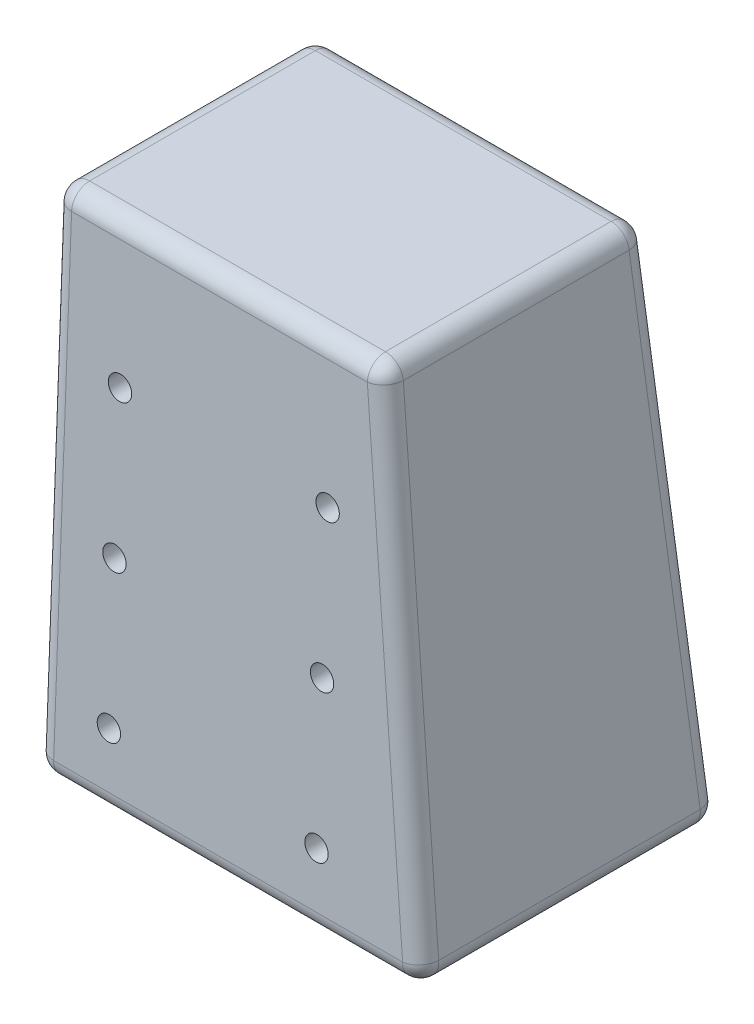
ISO-10303-21;
HEADER;
FILE_DESCRIPTION(('STEP AP214'),'2;1');
FILE_NAME('part.step','',(''),(''),'','','');
FILE_SCHEMA(('AUTOMOTIVE_DESIGN { 1 0 10303 214 1 1 1 1 }'));
ENDSEC;
DATA;
#1=APPLICATION_CONTEXT('core data for automotive mechanical design processes');
#2=APPLICATION_PROTOCOL_DEFINITION('international standard','automotive_design',2000,#1);
#3=PRODUCT_CONTEXT('',#1,'mechanical');
#4=PRODUCT('Part','Part','',(#3));
#5=PRODUCT_RELATED_PRODUCT_CATEGORY('part','',(#4));
#6=PRODUCT_DEFINITION_FORMATION('','',#4);
#7=PRODUCT_DEFINITION_CONTEXT('part definition',#1,'design');
#8=PRODUCT_DEFINITION('design','',#6,#7);
#9=PRODUCT_DEFINITION_SHAPE('','',#8);
#10=(LENGTH_UNIT() NAMED_UNIT(*) SI_UNIT(.MILLI.,.METRE.));
#11=(NAMED_UNIT(*) PLANE_ANGLE_UNIT() SI_UNIT($,.RADIAN.));
#12=(NAMED_UNIT(*) SI_UNIT($,.STERADIAN.) SOLID_ANGLE_UNIT());
#13=UNCERTAINTY_MEASURE_WITH_UNIT(LENGTH_MEASURE(1.E-05),#10,'distance_accuracy_value','');
#14=(GEOMETRIC_REPRESENTATION_CONTEXT(3) GLOBAL_UNCERTAINTY_ASSIGNED_CONTEXT((#13)) GLOBAL_UNIT_ASSIGNED_CONTEXT((#10,
#11,#12)) REPRESENTATION_CONTEXT('',''));
#15=CARTESIAN_POINT('',(0.,0.,0.));
#16=DIRECTION('',(0.,0.,1.));
#17=DIRECTION('',(1.,0.,0.));
#18=AXIS2_PLACEMENT_3D('',#15,#16,#17);
#19=CARTESIAN_POINT('',(2.5,2.5,0.));
#20=DIRECTION('',(0.,0.,1.));
#21=DIRECTION('',(1.,0.,0.));
#22=AXIS2_PLACEMENT_3D('',#19,#20,#21);
#23=CYLINDRICAL_SURFACE('',#22,2.5);
#24=CARTESIAN_POINT('',(2.5,2.5,-10.2999999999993));
#25=DIRECTION('',(0.,0.,-1.));
#26=DIRECTION('',(-1.,0.,0.));
#27=AXIS2_PLACEMENT_3D('',#24,#25,#26);
#28=CIRCLE('',#27,2.5);
#29=CARTESIAN_POINT('',(0.,2.5,-10.2999999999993));
#30=VERTEX_POINT('',#29);
#31=CARTESIAN_POINT('',(2.5,0.,-10.2999999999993));
#32=VERTEX_POINT('',#31);
#33=EDGE_CURVE('E12',#30,#32,#28,.F.);
#34=ORIENTED_EDGE('',*,*,#33,.F.);
#35=DIRECTION('',(0.,0.,1.));
#36=VECTOR('',#35,1.);
#37=CARTESIAN_POINT('',(0.,2.5,0.));
#38=LINE('',#37,#36);
#39=CARTESIAN_POINT('',(0.,2.5,-18.0810994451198));
#40=VERTEX_POINT('',#39);
#41=EDGE_CURVE('E231',#40,#30,#38,.T.);
#42=ORIENTED_EDGE('',*,*,#41,.F.);
#43=CARTESIAN_POINT('',(2.5,2.5,-18.0810994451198));
#44=DIRECTION('',(0.,0.,-1.));
#45=DIRECTION('',(-1.,0.,0.));
#46=AXIS2_PLACEMENT_3D('',#43,#44,#45);
#47=CIRCLE('',#46,2.5);
#48=CARTESIAN_POINT('',(2.5,0.,-18.0810994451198));
#49=VERTEX_POINT('',#48);
#50=EDGE_CURVE('E274',#49,#40,#47,.T.);
#51=ORIENTED_EDGE('',*,*,#50,.F.);
#52=DIRECTION('',(0.,0.,1.));
#53=VECTOR('',#52,1.);
#54=CARTESIAN_POINT('',(2.5,0.,0.));
#55=LINE('',#54,#53);
#56=EDGE_CURVE('E214',#32,#49,#55,.F.);
#57=ORIENTED_EDGE('',*,*,#56,.F.);
#58=EDGE_LOOP('',(#34,#42,#51,#57));
#59=FACE_BOUND('',#58,.T.);
#60=ADVANCED_FACE('F49',(#59),#23,.T.);
#61=CARTESIAN_POINT('',(0.,69.5155540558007,0.));
#62=DIRECTION('',(0.,1.,0.));
#63=DIRECTION('',(0.,0.,1.));
#64=AXIS2_PLACEMENT_3D('',#61,#62,#63);
#65=PLANE('',#64);
#66=DIRECTION('',(0.,0.,-1.));
#67=VECTOR('',#66,1.);
#68=CARTESIAN_POINT('',(2.5,69.5155540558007,0.));
#69=LINE('',#68,#67);
#70=CARTESIAN_POINT('',(2.5,69.5155540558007,-15.6028045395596));
#71=VERTEX_POINT('',#70);
#72=CARTESIAN_POINT('',(2.5,69.5155540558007,15.6028045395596));
#73=VERTEX_POINT('',#72);
#74=EDGE_CURVE('E74',#71,#73,#69,.F.);
#75=ORIENTED_EDGE('',*,*,#74,.T.);
#76=DIRECTION('',(1.,0.,0.));
#77=VECTOR('',#76,1.);
#78=CARTESIAN_POINT('',(45.6183159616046,69.5155540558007,15.6028045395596));
#79=LINE('',#78,#77);
#80=CARTESIAN_POINT('',(43.3870471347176,69.5155540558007,15.6028045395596));
#81=VERTEX_POINT('',#80);
#82=EDGE_CURVE('E264',#73,#81,#79,.T.);
#83=ORIENTED_EDGE('',*,*,#82,.T.);
#84=DIRECTION('',(0.,0.,1.));
#85=VECTOR('',#84,1.);
#86=CARTESIAN_POINT('',(43.3870471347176,69.5155540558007,0.));
#87=LINE('',#86,#85);
#88=CARTESIAN_POINT('',(43.3870471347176,69.5155540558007,-15.6028045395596));
#89=VERTEX_POINT('',#88);
#90=EDGE_CURVE('E259',#81,#89,#87,.F.);
#91=ORIENTED_EDGE('',*,*,#90,.T.);
#92=DIRECTION('',(1.,0.,0.));
#93=VECTOR('',#92,1.);
#94=CARTESIAN_POINT('',(0.,69.5155540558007,-15.6028045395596));
#95=LINE('',#94,#93);
#96=EDGE_CURVE('E261',#89,#71,#95,.F.);
#97=ORIENTED_EDGE('',*,*,#96,.T.);
#98=EDGE_LOOP('',(#75,#83,#91,#97));
#99=FACE_BOUND('',#98,.T.);
#100=ADVANCED_FACE('F455',(#99),#65,.T.);
#101=CARTESIAN_POINT('',(0.,0.,0.));
#102=DIRECTION('',(0.,-1.,0.));
#103=DIRECTION('',(0.,0.,-1.));
#104=AXIS2_PLACEMENT_3D('',#101,#102,#103);
#105=PLANE('',#104);
#106=DIRECTION('',(-1.,0.,0.));
#107=VECTOR('',#106,1.);
#108=CARTESIAN_POINT('',(42.,0.,-10.2999999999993));
#109=LINE('',#108,#107);
#110=CARTESIAN_POINT('',(42.,0.,-10.2999999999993));
#111=VERTEX_POINT('',#110);
#112=EDGE_CURVE('E170',#111,#32,#109,.T.);
#113=ORIENTED_EDGE('',*,*,#112,.T.);
#114=ORIENTED_EDGE('',*,*,#56,.T.);
#115=DIRECTION('',(1.,0.,0.));
#116=VECTOR('',#115,1.);
#117=CARTESIAN_POINT('',(0.,0.,-18.0810994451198));
#118=LINE('',#117,#116);
#119=CARTESIAN_POINT('',(50.7396007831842,0.,-18.0810994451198));
#120=VERTEX_POINT('',#119);
#121=EDGE_CURVE('E216',#49,#120,#118,.T.);
#122=ORIENTED_EDGE('',*,*,#121,.T.);
#123=DIRECTION('',(0.,0.,1.));
#124=VECTOR('',#123,1.);
#125=CARTESIAN_POINT('',(50.7396007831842,0.,0.));
#126=LINE('',#125,#124);
#127=CARTESIAN_POINT('',(50.7396007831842,0.,18.0810994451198));
#128=VERTEX_POINT('',#127);
#129=EDGE_CURVE('E219',#120,#128,#126,.T.);
#130=ORIENTED_EDGE('',*,*,#129,.T.);
#131=DIRECTION('',(1.,0.,0.));
#132=VECTOR('',#131,1.);
#133=CARTESIAN_POINT('',(0.,0.,18.0810994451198));
#134=LINE('',#133,#132);
#135=CARTESIAN_POINT('',(2.5,0.,18.0810994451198));
#136=VERTEX_POINT('',#135);
#137=EDGE_CURVE('E213',#128,#136,#134,.F.);
#138=ORIENTED_EDGE('',*,*,#137,.T.);
#139=CARTESIAN_POINT('',(2.5,0.,10.3000000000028));
#140=VERTEX_POINT('',#139);
#141=EDGE_CURVE('E211',#136,#140,#55,.F.);
#142=ORIENTED_EDGE('',*,*,#141,.T.);
#143=DIRECTION('',(-1.,0.,0.));
#144=VECTOR('',#143,1.);
#145=CARTESIAN_POINT('',(42.,0.,10.3000000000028));
#146=LINE('',#145,#144);
#147=CARTESIAN_POINT('',(42.,0.,10.3000000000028));
#148=VERTEX_POINT('',#147);
#149=EDGE_CURVE('E66',#148,#140,#146,.T.);
#150=ORIENTED_EDGE('',*,*,#149,.F.);
#151=DIRECTION('',(0.,0.,1.));
#152=VECTOR('',#151,1.);
#153=CARTESIAN_POINT('',(42.,0.,-10.2999999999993));
#154=LINE('',#153,#152);
#155=EDGE_CURVE('E185',#111,#148,#154,.T.);
#156=ORIENTED_EDGE('',*,*,#155,.F.);
#157=EDGE_LOOP('',(#113,#114,#122,#130,#138,#142,#150,#156));
#158=FACE_BOUND('',#157,.T.);
#159=ADVANCED_FACE('F189',(#158),#105,.T.);
#160=CARTESIAN_POINT('',(0.,0.793190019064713,-20.6485085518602));
#161=DIRECTION('',(0.,0.0383856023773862,-0.999263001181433));
#162=DIRECTION('',(0.,0.999263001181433,0.0383856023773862));
#163=AXIS2_PLACEMENT_3D('',#160,#161,#162);
#164=PLANE('',#163);
#165=CARTESIAN_POINT('',(38.5546786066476,49.9999999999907,-18.7582824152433));
#166=DIRECTION('',(0.,0.0383856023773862,-0.999263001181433));
#167=DIRECTION('',(0.,-0.999263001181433,-0.0383856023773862));
#168=AXIS2_PLACEMENT_3D('',#165,#166,#167);
#169=ELLIPSE('',#168,1.6137212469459,1.61253193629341);
#170=CARTESIAN_POINT('',(38.5546786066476,48.3874680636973,-18.8202260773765));
#171=VERTEX_POINT('',#170);
#172=EDGE_CURVE('E200',#171,#171,#169,.T.);
#173=ORIENTED_EDGE('',*,*,#172,.F.);
#174=EDGE_LOOP('',(#173));
#175=FACE_BOUND('',#174,.T.);
#176=CARTESIAN_POINT('',(9.85161014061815,49.9999999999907,-18.7582824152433));
#177=DIRECTION('',(0.,0.0383856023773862,-0.999263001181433));
#178=DIRECTION('',(0.,-0.999263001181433,-0.0383856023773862));
#179=AXIS2_PLACEMENT_3D('',#176,#177,#178);
#180=ELLIPSE('',#179,1.6137212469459,1.61253193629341);
#181=CARTESIAN_POINT('',(9.85161014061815,48.3874680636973,-18.8202260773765));
#182=VERTEX_POINT('',#181);
#183=EDGE_CURVE('E371',#182,#182,#180,.T.);
#184=ORIENTED_EDGE('',*,*,#183,.F.);
#185=EDGE_LOOP('',(#184));
#186=FACE_BOUND('',#185,.T.);
#187=CARTESIAN_POINT('',(9.85161014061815,30.0013500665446,-19.526508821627));
#188=DIRECTION('',(0.,0.0383856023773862,-0.999263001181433));
#189=DIRECTION('',(0.,-0.999263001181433,-0.0383856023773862));
#190=AXIS2_PLACEMENT_3D('',#187,#188,#189);
#191=ELLIPSE('',#190,1.6137212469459,1.61253193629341);
#192=CARTESIAN_POINT('',(9.85161014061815,28.3888181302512,-19.5884524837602));
#193=VERTEX_POINT('',#192);
#194=EDGE_CURVE('E354',#193,#193,#191,.T.);
#195=ORIENTED_EDGE('',*,*,#194,.F.);
#196=EDGE_LOOP('',(#195));
#197=FACE_BOUND('',#196,.T.);
#198=CARTESIAN_POINT('',(9.85161014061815,10.0003879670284,-20.2948240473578));
#199=DIRECTION('',(0.,0.0383856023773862,-0.999263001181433));
#200=DIRECTION('',(0.,-0.999263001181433,-0.0383856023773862));
#201=AXIS2_PLACEMENT_3D('',#198,#199,#200);
#202=ELLIPSE('',#201,1.6137212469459,1.61253193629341);
#203=CARTESIAN_POINT('',(9.85161014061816,8.38785603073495,-20.356767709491));
#204=VERTEX_POINT('',#203);
#205=EDGE_CURVE('E350',#204,#204,#202,.T.);
#206=ORIENTED_EDGE('',*,*,#205,.F.);
#207=EDGE_LOOP('',(#206));
#208=FACE_BOUND('',#207,.T.);
#209=CARTESIAN_POINT('',(38.5546786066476,10.0003879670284,-20.2948240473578));
#210=DIRECTION('',(0.,0.0383856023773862,-0.999263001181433));
#211=DIRECTION('',(0.,-0.999263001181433,-0.0383856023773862));
#212=AXIS2_PLACEMENT_3D('',#209,#210,#211);
#213=ELLIPSE('',#212,1.6137212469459,1.61253193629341);
#214=CARTESIAN_POINT('',(38.5546786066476,8.38785603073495,-20.356767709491));
#215=VERTEX_POINT('',#214);
#216=EDGE_CURVE('E346',#215,#215,#213,.T.);
#217=ORIENTED_EDGE('',*,*,#216,.F.);
#218=EDGE_LOOP('',(#217));
#219=FACE_BOUND('',#218,.T.);
#220=CARTESIAN_POINT('',(38.5546786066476,30.0013500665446,-19.526508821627));
#221=DIRECTION('',(0.,0.0383856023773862,-0.999263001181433));
#222=DIRECTION('',(0.,-0.999263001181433,-0.0383856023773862));
#223=AXIS2_PLACEMENT_3D('',#220,#221,#222);
#224=ELLIPSE('',#223,1.6137212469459,1.61253193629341);
#225=CARTESIAN_POINT('',(38.5546786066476,28.3888181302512,-19.5884524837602));
#226=VERTEX_POINT('',#225);
#227=EDGE_CURVE('E341',#226,#226,#224,.T.);
#228=ORIENTED_EDGE('',*,*,#227,.F.);
#229=EDGE_LOOP('',(#228));
#230=FACE_BOUND('',#229,.T.);
#231=DIRECTION('',(-0.113150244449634,0.99284562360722,0.038139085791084));
#232=VECTOR('',#231,1.);
#233=CARTESIAN_POINT('',(50.2928065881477,6.51639443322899,-20.4286578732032));
#234=LINE('',#233,#232);
#235=CARTESIAN_POINT('',(43.3870471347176,67.1115180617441,-18.1009620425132));
#236=VERTEX_POINT('',#235);
#237=CARTESIAN_POINT('',(50.7396007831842,2.59596400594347,-20.5792569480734));
#238=VERTEX_POINT('',#237);
#239=EDGE_CURVE('E223',#236,#238,#234,.F.);
#240=ORIENTED_EDGE('',*,*,#239,.T.);
#241=DIRECTION('',(1.,0.,0.));
#242=VECTOR('',#241,1.);
#243=CARTESIAN_POINT('',(0.,2.59596400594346,-20.5792569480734));
#244=LINE('',#243,#242);
#245=CARTESIAN_POINT('',(2.5,2.59596400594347,-20.5792569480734));
#246=VERTEX_POINT('',#245);
#247=EDGE_CURVE('E227',#238,#246,#244,.F.);
#248=ORIENTED_EDGE('',*,*,#247,.T.);
#249=DIRECTION('',(0.,0.999263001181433,0.0383856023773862));
#250=VECTOR('',#249,1.);
#251=CARTESIAN_POINT('',(2.5,0.793190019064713,-20.6485085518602));
#252=LINE('',#251,#250);
#253=CARTESIAN_POINT('',(2.5,67.1115180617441,-18.1009620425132));
#254=VERTEX_POINT('',#253);
#255=EDGE_CURVE('E225',#246,#254,#252,.T.);
#256=ORIENTED_EDGE('',*,*,#255,.T.);
#257=DIRECTION('',(1.,0.,0.));
#258=VECTOR('',#257,1.);
#259=CARTESIAN_POINT('',(0.,67.1115180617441,-18.1009620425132));
#260=LINE('',#259,#258);
#261=EDGE_CURVE('E221',#254,#236,#260,.T.);
#262=ORIENTED_EDGE('',*,*,#261,.T.);
#263=EDGE_LOOP('',(#240,#248,#256,#262));
#264=FACE_BOUND('',#263,.T.);
#265=ADVANCED_FACE('F385',(#175,#186,#197,#208,#219,#230,#264),#164,.T.);
#266=CARTESIAN_POINT('',(52.8542186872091,6.02356259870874,0.));
#267=DIRECTION('',(0.993568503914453,0.113232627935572,0.));
#268=DIRECTION('',(-0.113232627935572,0.993568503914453,0.));
#269=AXIS2_PLACEMENT_3D('',#266,#267,#268);
#270=PLANE('',#269);
#271=DIRECTION('',(-0.113150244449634,0.99284562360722,-0.038139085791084));
#272=VECTOR('',#271,1.);
#273=CARTESIAN_POINT('',(53.5514472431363,-0.0943236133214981,18.1916318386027));
#274=LINE('',#273,#272);
#275=CARTESIAN_POINT('',(45.8709683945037,67.2986356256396,15.6028045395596));
#276=VERTEX_POINT('',#275);
#277=CARTESIAN_POINT('',(53.2235220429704,2.78308156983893,18.0810994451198));
#278=VERTEX_POINT('',#277);
#279=EDGE_CURVE('E254',#276,#278,#274,.F.);
#280=ORIENTED_EDGE('',*,*,#279,.T.);
#281=DIRECTION('',(0.,0.,1.));
#282=VECTOR('',#281,1.);
#283=CARTESIAN_POINT('',(53.2235220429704,2.78308156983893,0.));
#284=LINE('',#283,#282);
#285=CARTESIAN_POINT('',(53.2235220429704,2.78308156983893,-18.0810994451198));
#286=VERTEX_POINT('',#285);
#287=EDGE_CURVE('E256',#278,#286,#284,.F.);
#288=ORIENTED_EDGE('',*,*,#287,.T.);
#289=DIRECTION('',(-0.113150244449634,0.99284562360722,0.038139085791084));
#290=VECTOR('',#289,1.);
#291=CARTESIAN_POINT('',(52.7767278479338,6.70351199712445,-17.9305003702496));
#292=LINE('',#291,#290);
#293=CARTESIAN_POINT('',(45.8709683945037,67.2986356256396,-15.6028045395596));
#294=VERTEX_POINT('',#293);
#295=EDGE_CURVE('E252',#286,#294,#292,.T.);
#296=ORIENTED_EDGE('',*,*,#295,.T.);
#297=DIRECTION('',(0.,0.,1.));
#298=VECTOR('',#297,1.);
#299=CARTESIAN_POINT('',(45.8709683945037,67.2986356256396,0.));
#300=LINE('',#299,#298);
#301=EDGE_CURVE('E250',#294,#276,#300,.T.);
#302=ORIENTED_EDGE('',*,*,#301,.T.);
#303=EDGE_LOOP('',(#280,#288,#296,#302));
#304=FACE_BOUND('',#303,.T.);
#305=ADVANCED_FACE('F388',(#304),#270,.T.);
#306=CARTESIAN_POINT('',(0.,0.,0.));
#307=DIRECTION('',(-1.,0.,0.));
#308=DIRECTION('',(0.,0.,1.));
#309=AXIS2_PLACEMENT_3D('',#306,#307,#308);
#310=PLANE('',#309);
#311=DIRECTION('',(0.,-1.,0.));
#312=VECTOR('',#311,1.);
#313=CARTESIAN_POINT('',(0.,0.,-10.2999999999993));
#314=LINE('',#313,#312);
#315=CARTESIAN_POINT('',(0.,60.5845814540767,-10.2999999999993));
#316=VERTEX_POINT('',#315);
#317=EDGE_CURVE('E197',#316,#30,#314,.T.);
#318=ORIENTED_EDGE('',*,*,#317,.F.);
#319=DIRECTION('',(0.,0.,-1.));
#320=VECTOR('',#319,1.);
#321=CARTESIAN_POINT('',(0.,60.5845814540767,-10.2999999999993));
#322=LINE('',#321,#320);
#323=CARTESIAN_POINT('',(0.,60.5845814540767,10.3000000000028));
#324=VERTEX_POINT('',#323);
#325=EDGE_CURVE('E187',#324,#316,#322,.T.);
#326=ORIENTED_EDGE('',*,*,#325,.F.);
#327=DIRECTION('',(0.,1.,0.));
#328=VECTOR('',#327,1.);
#329=CARTESIAN_POINT('',(0.,0.,10.3000000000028));
#330=LINE('',#329,#328);
#331=CARTESIAN_POINT('',(0.,2.5,10.3000000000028));
#332=VERTEX_POINT('',#331);
#333=EDGE_CURVE('E199',#332,#324,#330,.T.);
#334=ORIENTED_EDGE('',*,*,#333,.F.);
#335=CARTESIAN_POINT('',(0.,2.5,18.0810994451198));
#336=VERTEX_POINT('',#335);
#337=EDGE_CURVE('E230',#332,#336,#38,.T.);
#338=ORIENTED_EDGE('',*,*,#337,.T.);
#339=DIRECTION('',(0.,0.999263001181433,-0.0383856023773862));
#340=VECTOR('',#339,1.);
#341=CARTESIAN_POINT('',(0.,69.4195900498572,15.5104561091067));
#342=LINE('',#341,#340);
#343=CARTESIAN_POINT('',(0.,67.0155540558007,15.6028045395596));
#344=VERTEX_POINT('',#343);
#345=EDGE_CURVE('E234',#336,#344,#342,.T.);
#346=ORIENTED_EDGE('',*,*,#345,.T.);
#347=DIRECTION('',(0.,0.,-1.));
#348=VECTOR('',#347,1.);
#349=CARTESIAN_POINT('',(0.,67.0155540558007,0.));
#350=LINE('',#349,#348);
#351=CARTESIAN_POINT('',(0.,67.0155540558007,-15.6028045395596));
#352=VERTEX_POINT('',#351);
#353=EDGE_CURVE('E239',#344,#352,#350,.T.);
#354=ORIENTED_EDGE('',*,*,#353,.T.);
#355=DIRECTION('',(0.,0.999263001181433,0.0383856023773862));
#356=VECTOR('',#355,1.);
#357=CARTESIAN_POINT('',(0.,0.697226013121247,-18.1503510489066));
#358=LINE('',#357,#356);
#359=EDGE_CURVE('E236',#352,#40,#358,.F.);
#360=ORIENTED_EDGE('',*,*,#359,.T.);
#361=ORIENTED_EDGE('',*,*,#41,.T.);
#362=EDGE_LOOP('',(#318,#326,#334,#338,#346,#354,#360,#361));
#363=FACE_BOUND('',#362,.T.);
#364=ADVANCED_FACE('F507',(#363),#310,.T.);
#365=CARTESIAN_POINT('',(0.,0.793190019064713,20.6485085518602));
#366=DIRECTION('',(0.,-0.0383856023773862,-0.999263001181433));
#367=DIRECTION('',(0.,0.999263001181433,-0.0383856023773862));
#368=AXIS2_PLACEMENT_3D('',#365,#366,#367);
#369=PLANE('',#368);
#370=CARTESIAN_POINT('',(38.5546786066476,49.9999999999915,18.7582824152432));
#371=DIRECTION('',(0.,-0.0383856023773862,-0.999263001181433));
#372=DIRECTION('',(0.,0.999263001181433,-0.0383856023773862));
#373=AXIS2_PLACEMENT_3D('',#370,#371,#372);
#374=ELLIPSE('',#373,1.6137212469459,1.61253193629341);
#375=CARTESIAN_POINT('',(38.5546786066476,51.6125319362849,18.69633875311));
#376=VERTEX_POINT('',#375);
#377=EDGE_CURVE('E377',#376,#376,#374,.T.);
#378=ORIENTED_EDGE('',*,*,#377,.T.);
#379=EDGE_LOOP('',(#378));
#380=FACE_BOUND('',#379,.T.);
#381=CARTESIAN_POINT('',(9.85161014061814,49.9999999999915,18.7582824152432));
#382=DIRECTION('',(0.,-0.0383856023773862,-0.999263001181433));
#383=DIRECTION('',(0.,0.999263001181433,-0.0383856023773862));
#384=AXIS2_PLACEMENT_3D('',#381,#382,#383);
#385=ELLIPSE('',#384,1.6137212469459,1.61253193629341);
#386=CARTESIAN_POINT('',(9.85161014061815,51.6125319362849,18.69633875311));
#387=VERTEX_POINT('',#386);
#388=EDGE_CURVE('E358',#387,#387,#385,.T.);
#389=ORIENTED_EDGE('',*,*,#388,.T.);
#390=EDGE_LOOP('',(#389));
#391=FACE_BOUND('',#390,.T.);
#392=CARTESIAN_POINT('',(9.85161014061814,30.0013500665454,19.5265088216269));
#393=DIRECTION('',(0.,-0.0383856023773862,-0.999263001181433));
#394=DIRECTION('',(0.,0.999263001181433,-0.0383856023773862));
#395=AXIS2_PLACEMENT_3D('',#392,#393,#394);
#396=ELLIPSE('',#395,1.6137212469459,1.61253193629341);
#397=CARTESIAN_POINT('',(9.85161014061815,31.6138820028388,19.4645651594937));
#398=VERTEX_POINT('',#397);
#399=EDGE_CURVE('E361',#398,#398,#396,.T.);
#400=ORIENTED_EDGE('',*,*,#399,.T.);
#401=EDGE_LOOP('',(#400));
#402=FACE_BOUND('',#401,.T.);
#403=CARTESIAN_POINT('',(9.85161014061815,10.0003879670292,20.2948240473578));
#404=DIRECTION('',(0.,-0.0383856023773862,-0.999263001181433));
#405=DIRECTION('',(0.,0.999263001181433,-0.0383856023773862));
#406=AXIS2_PLACEMENT_3D('',#403,#404,#405);
#407=ELLIPSE('',#406,1.6137212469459,1.61253193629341);
#408=CARTESIAN_POINT('',(9.85161014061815,11.6129199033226,20.2328803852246));
#409=VERTEX_POINT('',#408);
#410=EDGE_CURVE('E727',#409,#409,#407,.T.);
#411=ORIENTED_EDGE('',*,*,#410,.T.);
#412=EDGE_LOOP('',(#411));
#413=FACE_BOUND('',#412,.T.);
#414=CARTESIAN_POINT('',(38.5546786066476,10.0003879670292,20.2948240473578));
#415=DIRECTION('',(0.,-0.0383856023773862,-0.999263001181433));
#416=DIRECTION('',(0.,0.999263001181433,-0.0383856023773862));
#417=AXIS2_PLACEMENT_3D('',#414,#415,#416);
#418=ELLIPSE('',#417,1.6137212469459,1.61253193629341);
#419=CARTESIAN_POINT('',(38.5546786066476,11.6129199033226,20.2328803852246));
#420=VERTEX_POINT('',#419);
#421=EDGE_CURVE('E722',#420,#420,#418,.T.);
#422=ORIENTED_EDGE('',*,*,#421,.T.);
#423=EDGE_LOOP('',(#422));
#424=FACE_BOUND('',#423,.T.);
#425=CARTESIAN_POINT('',(38.5546786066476,30.0013500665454,19.5265088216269));
#426=DIRECTION('',(0.,-0.0383856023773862,-0.999263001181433));
#427=DIRECTION('',(0.,0.999263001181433,-0.0383856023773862));
#428=AXIS2_PLACEMENT_3D('',#425,#426,#427);
#429=ELLIPSE('',#428,1.6137212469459,1.61253193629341);
#430=CARTESIAN_POINT('',(38.5546786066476,31.6138820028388,19.4645651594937));
#431=VERTEX_POINT('',#430);
#432=EDGE_CURVE('E715',#431,#431,#429,.T.);
#433=ORIENTED_EDGE('',*,*,#432,.T.);
#434=EDGE_LOOP('',(#433));
#435=FACE_BOUND('',#434,.T.);
#436=DIRECTION('',(0.,0.999263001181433,-0.0383856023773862));
#437=VECTOR('',#436,1.);
#438=CARTESIAN_POINT('',(2.5,0.,20.6789780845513));
#439=LINE('',#438,#437);
#440=CARTESIAN_POINT('',(2.5,67.1115180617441,18.1009620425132));
#441=VERTEX_POINT('',#440);
#442=CARTESIAN_POINT('',(2.5,2.59596400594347,20.5792569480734));
#443=VERTEX_POINT('',#442);
#444=EDGE_CURVE('E245',#441,#443,#439,.F.);
#445=ORIENTED_EDGE('',*,*,#444,.T.);
#446=DIRECTION('',(1.,0.,0.));
#447=VECTOR('',#446,1.);
#448=CARTESIAN_POINT('',(53.5406975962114,2.59596400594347,20.5792569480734));
#449=LINE('',#448,#447);
#450=CARTESIAN_POINT('',(50.7396007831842,2.59596400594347,20.5792569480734));
#451=VERTEX_POINT('',#450);
#452=EDGE_CURVE('E247',#443,#451,#449,.T.);
#453=ORIENTED_EDGE('',*,*,#452,.T.);
#454=DIRECTION('',(-0.113150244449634,0.99284562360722,-0.038139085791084));
#455=VECTOR('',#454,1.);
#456=CARTESIAN_POINT('',(43.1451443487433,69.2341128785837,18.0194248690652));
#457=LINE('',#456,#455);
#458=CARTESIAN_POINT('',(43.3870471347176,67.1115180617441,18.1009620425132));
#459=VERTEX_POINT('',#458);
#460=EDGE_CURVE('E243',#451,#459,#457,.T.);
#461=ORIENTED_EDGE('',*,*,#460,.T.);
#462=DIRECTION('',(1.,0.,0.));
#463=VECTOR('',#462,1.);
#464=CARTESIAN_POINT('',(0.,67.1115180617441,18.1009620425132));
#465=LINE('',#464,#463);
#466=EDGE_CURVE('E241',#459,#441,#465,.F.);
#467=ORIENTED_EDGE('',*,*,#466,.T.);
#468=EDGE_LOOP('',(#445,#453,#461,#467));
#469=FACE_BOUND('',#468,.T.);
#470=ADVANCED_FACE('F530',(#380,#391,#402,#413,#424,#435,#469),#369,.F.);
#471=CARTESIAN_POINT('',(0.,67.0155540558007,15.6028045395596));
#472=DIRECTION('',(-1.,0.,0.));
#473=DIRECTION('',(0.,0.,1.));
#474=AXIS2_PLACEMENT_3D('',#471,#472,#473);
#475=CYLINDRICAL_SURFACE('',#474,2.5);
#476=CARTESIAN_POINT('',(2.5,67.0155540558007,15.6028045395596));
#477=DIRECTION('',(-1.,0.,0.));
#478=DIRECTION('',(0.,0.,1.));
#479=AXIS2_PLACEMENT_3D('',#476,#477,#478);
#480=CIRCLE('',#479,2.5);
#481=EDGE_CURVE('E329',#441,#73,#480,.T.);
#482=ORIENTED_EDGE('',*,*,#481,.F.);
#483=ORIENTED_EDGE('',*,*,#466,.F.);
#484=CARTESIAN_POINT('',(43.3870471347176,67.0155540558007,15.6028045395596));
#485=DIRECTION('',(1.,0.,0.));
#486=DIRECTION('',(0.,0.,-1.));
#487=AXIS2_PLACEMENT_3D('',#484,#485,#486);
#488=CIRCLE('',#487,2.5);
#489=EDGE_CURVE('E326',#81,#459,#488,.T.);
#490=ORIENTED_EDGE('',*,*,#489,.F.);
#491=ORIENTED_EDGE('',*,*,#82,.F.);
#492=EDGE_LOOP('',(#482,#483,#490,#491));
#493=FACE_BOUND('',#492,.T.);
#494=ADVANCED_FACE('F51',(#493),#475,.T.);
#495=CARTESIAN_POINT('',(2.5,67.0155540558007,15.6028045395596));
#496=DIRECTION('',(-1.,0.,0.));
#497=DIRECTION('',(0.,0.,1.));
#498=AXIS2_PLACEMENT_3D('',#495,#496,#497);
#499=SPHERICAL_SURFACE('',#498,2.5);
#500=CARTESIAN_POINT('',(2.5,67.0155540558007,15.6028045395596));
#501=DIRECTION('',(0.,0.999263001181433,-0.0383856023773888));
#502=DIRECTION('',(0.,0.0383856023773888,0.999263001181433));
#503=AXIS2_PLACEMENT_3D('',#500,#501,#502);
#504=CIRCLE('',#503,2.5);
#505=EDGE_CURVE('E320',#441,#344,#504,.F.);
#506=ORIENTED_EDGE('',*,*,#505,.F.);
#507=ORIENTED_EDGE('',*,*,#481,.T.);
#508=CARTESIAN_POINT('',(2.5,67.0155540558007,15.6028045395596));
#509=DIRECTION('',(0.,0.,1.));
#510=DIRECTION('',(1.,0.,0.));
#511=AXIS2_PLACEMENT_3D('',#508,#509,#510);
#512=CIRCLE('',#511,2.5);
#513=EDGE_CURVE('E323',#344,#73,#512,.F.);
#514=ORIENTED_EDGE('',*,*,#513,.F.);
#515=EDGE_LOOP('',(#506,#507,#514));
#516=FACE_BOUND('',#515,.T.);
#517=ADVANCED_FACE('F449',(#516),#499,.T.);
#518=CARTESIAN_POINT('',(43.3870471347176,67.0155540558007,15.6028045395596));
#519=DIRECTION('',(0.,0.0383856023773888,0.999263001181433));
#520=DIRECTION('',(0.,-0.999263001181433,0.0383856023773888));
#521=AXIS2_PLACEMENT_3D('',#518,#519,#520);
#522=SPHERICAL_SURFACE('',#521,2.5);
#523=CARTESIAN_POINT('',(43.3870471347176,67.0155540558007,15.6028045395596));
#524=DIRECTION('',(0.,0.,1.));
#525=DIRECTION('',(0.,-1.,0.));
#526=AXIS2_PLACEMENT_3D('',#523,#524,#525);
#527=CIRCLE('',#526,2.5);
#528=EDGE_CURVE('E314',#81,#276,#527,.F.);
#529=ORIENTED_EDGE('',*,*,#528,.F.);
#530=ORIENTED_EDGE('',*,*,#489,.T.);
#531=CARTESIAN_POINT('',(43.3870471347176,67.0155540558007,15.6028045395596));
#532=DIRECTION('',(-0.113150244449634,0.992845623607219,-0.0381390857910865));
#533=DIRECTION('',(-0.993568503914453,-0.113232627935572,0.));
#534=AXIS2_PLACEMENT_3D('',#531,#532,#533);
#535=CIRCLE('',#534,2.5);
#536=EDGE_CURVE('E317',#276,#459,#535,.F.);
#537=ORIENTED_EDGE('',*,*,#536,.F.);
#538=EDGE_LOOP('',(#529,#530,#537));
#539=FACE_BOUND('',#538,.T.);
#540=ADVANCED_FACE('F746',(#539),#522,.T.);
#541=CARTESIAN_POINT('',(2.5,67.0155540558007,0.));
#542=DIRECTION('',(0.,0.,-1.));
#543=DIRECTION('',(-1.,0.,0.));
#544=AXIS2_PLACEMENT_3D('',#541,#542,#543);
#545=CYLINDRICAL_SURFACE('',#544,2.5);
#546=ORIENTED_EDGE('',*,*,#513,.T.);
#547=ORIENTED_EDGE('',*,*,#74,.F.);
#548=CARTESIAN_POINT('',(2.5,67.0155540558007,-15.6028045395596));
#549=DIRECTION('',(0.,0.,-1.));
#550=DIRECTION('',(-1.,0.,0.));
#551=AXIS2_PLACEMENT_3D('',#548,#549,#550);
#552=CIRCLE('',#551,2.5);
#553=EDGE_CURVE('E308',#352,#71,#552,.T.);
#554=ORIENTED_EDGE('',*,*,#553,.F.);
#555=ORIENTED_EDGE('',*,*,#353,.F.);
#556=EDGE_LOOP('',(#546,#547,#554,#555));
#557=FACE_BOUND('',#556,.T.);
#558=ADVANCED_FACE('F445',(#557),#545,.T.);
#559=CARTESIAN_POINT('',(2.5,0.697226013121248,18.1503510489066));
#560=DIRECTION('',(0.,-0.999263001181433,0.0383856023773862));
#561=DIRECTION('',(0.,-0.0383856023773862,-0.999263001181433));
#562=AXIS2_PLACEMENT_3D('',#559,#560,#561);
#563=CYLINDRICAL_SURFACE('',#562,2.5);
#564=ORIENTED_EDGE('',*,*,#505,.T.);
#565=ORIENTED_EDGE('',*,*,#345,.F.);
#566=CARTESIAN_POINT('',(2.5,2.5,18.0810994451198));
#567=DIRECTION('',(0.,-0.999263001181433,0.0383856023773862));
#568=DIRECTION('',(0.,-0.0383856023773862,-0.999263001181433));
#569=AXIS2_PLACEMENT_3D('',#566,#567,#568);
#570=CIRCLE('',#569,2.5);
#571=EDGE_CURVE('E305',#443,#336,#570,.T.);
#572=ORIENTED_EDGE('',*,*,#571,.F.);
#573=ORIENTED_EDGE('',*,*,#444,.F.);
#574=EDGE_LOOP('',(#564,#565,#572,#573));
#575=FACE_BOUND('',#574,.T.);
#576=ADVANCED_FACE('F504',(#575),#563,.T.);
#577=CARTESIAN_POINT('',(0.,2.5,18.0810994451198));
#578=DIRECTION('',(-1.,0.,0.));
#579=DIRECTION('',(0.,0.,1.));
#580=AXIS2_PLACEMENT_3D('',#577,#578,#579);
#581=CYLINDRICAL_SURFACE('',#580,2.5);
#582=CARTESIAN_POINT('',(50.7396007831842,2.5,18.0810994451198));
#583=DIRECTION('',(1.,0.,0.));
#584=DIRECTION('',(0.,0.,-1.));
#585=AXIS2_PLACEMENT_3D('',#582,#583,#584);
#586=CIRCLE('',#585,2.5);
#587=EDGE_CURVE('E299',#451,#128,#586,.T.);
#588=ORIENTED_EDGE('',*,*,#587,.F.);
#589=ORIENTED_EDGE('',*,*,#452,.F.);
#590=CARTESIAN_POINT('',(2.5,2.5,18.0810994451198));
#591=DIRECTION('',(-1.,0.,0.));
#592=DIRECTION('',(0.,0.,1.));
#593=AXIS2_PLACEMENT_3D('',#590,#591,#592);
#594=CIRCLE('',#593,2.5);
#595=EDGE_CURVE('E302',#136,#443,#594,.T.);
#596=ORIENTED_EDGE('',*,*,#595,.F.);
#597=ORIENTED_EDGE('',*,*,#137,.F.);
#598=EDGE_LOOP('',(#588,#589,#596,#597));
#599=FACE_BOUND('',#598,.T.);
#600=ADVANCED_FACE('F499',(#599),#581,.T.);
#601=CARTESIAN_POINT('',(50.2928065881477,6.42043042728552,17.9305003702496));
#602=DIRECTION('',(0.113150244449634,-0.99284562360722,0.038139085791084));
#603=DIRECTION('',(0.993568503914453,0.113232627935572,0.));
#604=AXIS2_PLACEMENT_3D('',#601,#602,#603);
#605=CYLINDRICAL_SURFACE('',#604,2.5);
#606=ORIENTED_EDGE('',*,*,#536,.T.);
#607=ORIENTED_EDGE('',*,*,#460,.F.);
#608=CARTESIAN_POINT('',(50.7396007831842,2.5,18.0810994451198));
#609=DIRECTION('',(0.113150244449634,-0.992845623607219,0.0381390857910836));
#610=DIRECTION('',(0.993568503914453,0.113232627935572,0.));
#611=AXIS2_PLACEMENT_3D('',#608,#609,#610);
#612=CIRCLE('',#611,2.5);
#613=EDGE_CURVE('E297',#278,#451,#612,.T.);
#614=ORIENTED_EDGE('',*,*,#613,.F.);
#615=ORIENTED_EDGE('',*,*,#279,.F.);
#616=EDGE_LOOP('',(#606,#607,#614,#615));
#617=FACE_BOUND('',#616,.T.);
#618=ADVANCED_FACE('F742',(#617),#605,.T.);
#619=CARTESIAN_POINT('',(43.3870471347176,67.0155540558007,0.));
#620=DIRECTION('',(0.,0.,1.));
#621=DIRECTION('',(1.,0.,0.));
#622=AXIS2_PLACEMENT_3D('',#619,#620,#621);
#623=CYLINDRICAL_SURFACE('',#622,2.5);
#624=ORIENTED_EDGE('',*,*,#528,.T.);
#625=ORIENTED_EDGE('',*,*,#301,.F.);
#626=CARTESIAN_POINT('',(43.3870471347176,67.0155540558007,-15.6028045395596));
#627=DIRECTION('',(0.,0.,-1.));
#628=DIRECTION('',(-1.,0.,0.));
#629=AXIS2_PLACEMENT_3D('',#626,#627,#628);
#630=CIRCLE('',#629,2.5);
#631=EDGE_CURVE('E294',#89,#294,#630,.T.);
#632=ORIENTED_EDGE('',*,*,#631,.F.);
#633=ORIENTED_EDGE('',*,*,#90,.F.);
#634=EDGE_LOOP('',(#624,#625,#632,#633));
#635=FACE_BOUND('',#634,.T.);
#636=ADVANCED_FACE('F460',(#635),#623,.T.);
#637=CARTESIAN_POINT('',(0.,67.0155540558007,-15.6028045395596));
#638=DIRECTION('',(1.,0.,0.));
#639=DIRECTION('',(0.,0.,-1.));
#640=AXIS2_PLACEMENT_3D('',#637,#638,#639);
#641=CYLINDRICAL_SURFACE('',#640,2.5);
#642=CARTESIAN_POINT('',(2.5,67.0155540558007,-15.6028045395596));
#643=DIRECTION('',(-1.,0.,0.));
#644=DIRECTION('',(0.,0.,1.));
#645=AXIS2_PLACEMENT_3D('',#642,#643,#644);
#646=CIRCLE('',#645,2.5);
#647=EDGE_CURVE('E311',#71,#254,#646,.T.);
#648=ORIENTED_EDGE('',*,*,#647,.F.);
#649=ORIENTED_EDGE('',*,*,#96,.F.);
#650=CARTESIAN_POINT('',(43.3870471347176,67.0155540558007,-15.6028045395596));
#651=DIRECTION('',(1.,0.,0.));
#652=DIRECTION('',(0.,0.,-1.));
#653=AXIS2_PLACEMENT_3D('',#650,#651,#652);
#654=CIRCLE('',#653,2.5);
#655=EDGE_CURVE('E291',#236,#89,#654,.T.);
#656=ORIENTED_EDGE('',*,*,#655,.F.);
#657=ORIENTED_EDGE('',*,*,#261,.F.);
#658=EDGE_LOOP('',(#648,#649,#656,#657));
#659=FACE_BOUND('',#658,.T.);
#660=ADVANCED_FACE('F437',(#659),#641,.T.);
#661=CARTESIAN_POINT('',(2.5,67.0155540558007,-15.6028045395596));
#662=DIRECTION('',(-1.,0.,0.));
#663=DIRECTION('',(0.,0.,1.));
#664=AXIS2_PLACEMENT_3D('',#661,#662,#663);
#665=SPHERICAL_SURFACE('',#664,2.5);
#666=ORIENTED_EDGE('',*,*,#553,.T.);
#667=ORIENTED_EDGE('',*,*,#647,.T.);
#668=CARTESIAN_POINT('',(2.5,67.0155540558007,-15.6028045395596));
#669=DIRECTION('',(0.,0.999263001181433,0.0383856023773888));
#670=DIRECTION('',(0.,-0.0383856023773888,0.999263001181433));
#671=AXIS2_PLACEMENT_3D('',#668,#669,#670);
#672=CIRCLE('',#671,2.5);
#673=EDGE_CURVE('E288',#352,#254,#672,.F.);
#674=ORIENTED_EDGE('',*,*,#673,.F.);
#675=EDGE_LOOP('',(#666,#667,#674));
#676=FACE_BOUND('',#675,.T.);
#677=ADVANCED_FACE('F441',(#676),#665,.T.);
#678=CARTESIAN_POINT('',(2.5,2.5,18.0810994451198));
#679=DIRECTION('',(-1.,0.,0.));
#680=DIRECTION('',(0.,0.,1.));
#681=AXIS2_PLACEMENT_3D('',#678,#679,#680);
#682=SPHERICAL_SURFACE('',#681,2.5);
#683=ORIENTED_EDGE('',*,*,#595,.T.);
#684=ORIENTED_EDGE('',*,*,#571,.T.);
#685=CARTESIAN_POINT('',(2.5,2.5,18.0810994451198));
#686=DIRECTION('',(0.,0.,1.));
#687=DIRECTION('',(1.,0.,0.));
#688=AXIS2_PLACEMENT_3D('',#685,#686,#687);
#689=CIRCLE('',#688,2.5);
#690=EDGE_CURVE('E285',#136,#336,#689,.F.);
#691=ORIENTED_EDGE('',*,*,#690,.F.);
#692=EDGE_LOOP('',(#683,#684,#691));
#693=FACE_BOUND('',#692,.T.);
#694=ADVANCED_FACE('F472',(#693),#682,.T.);
#695=CARTESIAN_POINT('',(50.7396007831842,2.5,18.0810994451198));
#696=DIRECTION('',(0.,0.0383856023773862,0.999263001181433));
#697=DIRECTION('',(0.,-0.999263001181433,0.0383856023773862));
#698=AXIS2_PLACEMENT_3D('',#695,#696,#697);
#699=SPHERICAL_SURFACE('',#698,2.5);
#700=ORIENTED_EDGE('',*,*,#613,.T.);
#701=ORIENTED_EDGE('',*,*,#587,.T.);
#702=CARTESIAN_POINT('',(50.7396007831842,2.5,18.0810994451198));
#703=DIRECTION('',(0.,0.,1.));
#704=DIRECTION('',(1.,0.,0.));
#705=AXIS2_PLACEMENT_3D('',#702,#703,#704);
#706=CIRCLE('',#705,2.5);
#707=EDGE_CURVE('E282',#278,#128,#706,.F.);
#708=ORIENTED_EDGE('',*,*,#707,.F.);
#709=EDGE_LOOP('',(#700,#701,#708));
#710=FACE_BOUND('',#709,.T.);
#711=ADVANCED_FACE('F464',(#710),#699,.T.);
#712=CARTESIAN_POINT('',(43.3870471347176,67.0155540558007,-15.6028045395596));
#713=DIRECTION('',(0.,0.0383856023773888,-0.999263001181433));
#714=DIRECTION('',(0.,0.999263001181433,0.0383856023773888));
#715=AXIS2_PLACEMENT_3D('',#712,#713,#714);
#716=SPHERICAL_SURFACE('',#715,2.5);
#717=ORIENTED_EDGE('',*,*,#655,.T.);
#718=ORIENTED_EDGE('',*,*,#631,.T.);
#719=CARTESIAN_POINT('',(43.3870471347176,67.0155540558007,-15.6028045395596));
#720=DIRECTION('',(-0.113150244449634,0.992845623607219,0.0381390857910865));
#721=DIRECTION('',(-0.993568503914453,-0.113232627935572,0.));
#722=AXIS2_PLACEMENT_3D('',#719,#720,#721);
#723=CIRCLE('',#722,2.5);
#724=EDGE_CURVE('E279',#236,#294,#723,.F.);
#725=ORIENTED_EDGE('',*,*,#724,.F.);
#726=EDGE_LOOP('',(#717,#718,#725));
#727=FACE_BOUND('',#726,.T.);
#728=ADVANCED_FACE('F462',(#727),#716,.T.);
#729=CARTESIAN_POINT('',(2.5,0.697226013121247,-18.1503510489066));
#730=DIRECTION('',(0.,0.999263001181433,0.0383856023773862));
#731=DIRECTION('',(0.,-0.0383856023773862,0.999263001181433));
#732=AXIS2_PLACEMENT_3D('',#729,#730,#731);
#733=CYLINDRICAL_SURFACE('',#732,2.5);
#734=ORIENTED_EDGE('',*,*,#673,.T.);
#735=ORIENTED_EDGE('',*,*,#255,.F.);
#736=CARTESIAN_POINT('',(2.5,2.5,-18.0810994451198));
#737=DIRECTION('',(0.,-0.999263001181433,-0.0383856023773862));
#738=DIRECTION('',(0.,0.0383856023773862,-0.999263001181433));
#739=AXIS2_PLACEMENT_3D('',#736,#737,#738);
#740=CIRCLE('',#739,2.5);
#741=EDGE_CURVE('E276',#40,#246,#740,.T.);
#742=ORIENTED_EDGE('',*,*,#741,.F.);
#743=ORIENTED_EDGE('',*,*,#359,.F.);
#744=EDGE_LOOP('',(#734,#735,#742,#743));
#745=FACE_BOUND('',#744,.T.);
#746=ADVANCED_FACE('F433',(#745),#733,.T.);
#747=CARTESIAN_POINT('',(2.5,2.5,10.3000000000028));
#748=DIRECTION('',(0.,0.,1.));
#749=DIRECTION('',(1.,0.,0.));
#750=AXIS2_PLACEMENT_3D('',#747,#748,#749);
#751=CIRCLE('',#750,2.5);
#752=EDGE_CURVE('E58',#140,#332,#751,.F.);
#753=ORIENTED_EDGE('',*,*,#752,.F.);
#754=ORIENTED_EDGE('',*,*,#141,.F.);
#755=ORIENTED_EDGE('',*,*,#690,.T.);
#756=ORIENTED_EDGE('',*,*,#337,.F.);
#757=EDGE_LOOP('',(#753,#754,#755,#756));
#758=FACE_BOUND('',#757,.T.);
#759=ADVANCED_FACE('F470',(#758),#23,.T.);
#760=CARTESIAN_POINT('',(50.7396007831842,2.5,0.));
#761=DIRECTION('',(0.,0.,1.));
#762=DIRECTION('',(1.,0.,0.));
#763=AXIS2_PLACEMENT_3D('',#760,#761,#762);
#764=CYLINDRICAL_SURFACE('',#763,2.5);
#765=ORIENTED_EDGE('',*,*,#707,.T.);
#766=ORIENTED_EDGE('',*,*,#129,.F.);
#767=CARTESIAN_POINT('',(50.7396007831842,2.5,-18.0810994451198));
#768=DIRECTION('',(0.,0.,-1.));
#769=DIRECTION('',(0.,1.,0.));
#770=AXIS2_PLACEMENT_3D('',#767,#768,#769);
#771=CIRCLE('',#770,2.5);
#772=EDGE_CURVE('E271',#286,#120,#771,.T.);
#773=ORIENTED_EDGE('',*,*,#772,.F.);
#774=ORIENTED_EDGE('',*,*,#287,.F.);
#775=EDGE_LOOP('',(#765,#766,#773,#774));
#776=FACE_BOUND('',#775,.T.);
#777=ADVANCED_FACE('F421',(#776),#764,.T.);
#778=CARTESIAN_POINT('',(50.2928065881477,6.42043042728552,-17.9305003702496));
#779=DIRECTION('',(-0.113150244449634,0.99284562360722,0.038139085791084));
#780=DIRECTION('',(-0.993568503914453,-0.113232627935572,0.));
#781=AXIS2_PLACEMENT_3D('',#778,#779,#780);
#782=CYLINDRICAL_SURFACE('',#781,2.5);
#783=ORIENTED_EDGE('',*,*,#724,.T.);
#784=ORIENTED_EDGE('',*,*,#295,.F.);
#785=CARTESIAN_POINT('',(50.7396007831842,2.5,-18.0810994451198));
#786=DIRECTION('',(0.113150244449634,-0.992845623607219,-0.038139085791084));
#787=DIRECTION('',(0.993568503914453,0.113232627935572,0.));
#788=AXIS2_PLACEMENT_3D('',#785,#786,#787);
#789=CIRCLE('',#788,2.5);
#790=EDGE_CURVE('E269',#238,#286,#789,.T.);
#791=ORIENTED_EDGE('',*,*,#790,.F.);
#792=ORIENTED_EDGE('',*,*,#239,.F.);
#793=EDGE_LOOP('',(#783,#784,#791,#792));
#794=FACE_BOUND('',#793,.T.);
#795=ADVANCED_FACE('F409',(#794),#782,.T.);
#796=CARTESIAN_POINT('',(2.5,2.5,-18.0810994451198));
#797=DIRECTION('',(-1.,0.,0.));
#798=DIRECTION('',(0.,0.,1.));
#799=AXIS2_PLACEMENT_3D('',#796,#797,#798);
#800=SPHERICAL_SURFACE('',#799,2.5);
#801=ORIENTED_EDGE('',*,*,#50,.T.);
#802=ORIENTED_EDGE('',*,*,#741,.T.);
#803=CARTESIAN_POINT('',(2.5,2.5,-18.0810994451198));
#804=DIRECTION('',(-1.,0.,0.));
#805=DIRECTION('',(0.,0.,1.));
#806=AXIS2_PLACEMENT_3D('',#803,#804,#805);
#807=CIRCLE('',#806,2.5);
#808=EDGE_CURVE('E267',#49,#246,#807,.F.);
#809=ORIENTED_EDGE('',*,*,#808,.F.);
#810=EDGE_LOOP('',(#801,#802,#809));
#811=FACE_BOUND('',#810,.T.);
#812=ADVANCED_FACE('F429',(#811),#800,.T.);
#813=CARTESIAN_POINT('',(50.7396007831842,2.5,-18.0810994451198));
#814=DIRECTION('',(0.,0.0383856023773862,-0.999263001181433));
#815=DIRECTION('',(0.,0.999263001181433,0.0383856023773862));
#816=AXIS2_PLACEMENT_3D('',#813,#814,#815);
#817=SPHERICAL_SURFACE('',#816,2.5);
#818=ORIENTED_EDGE('',*,*,#790,.T.);
#819=ORIENTED_EDGE('',*,*,#772,.T.);
#820=CARTESIAN_POINT('',(50.7396007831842,2.5,-18.0810994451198));
#821=DIRECTION('',(1.,0.,0.));
#822=DIRECTION('',(0.,0.,-1.));
#823=AXIS2_PLACEMENT_3D('',#820,#821,#822);
#824=CIRCLE('',#823,2.5);
#825=EDGE_CURVE('E206',#238,#120,#824,.F.);
#826=ORIENTED_EDGE('',*,*,#825,.F.);
#827=EDGE_LOOP('',(#818,#819,#826));
#828=FACE_BOUND('',#827,.T.);
#829=ADVANCED_FACE('F417',(#828),#817,.T.);
#830=CARTESIAN_POINT('',(0.,2.5,-18.0810994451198));
#831=DIRECTION('',(1.,0.,0.));
#832=DIRECTION('',(0.,0.,-1.));
#833=AXIS2_PLACEMENT_3D('',#830,#831,#832);
#834=CYLINDRICAL_SURFACE('',#833,2.5);
#835=ORIENTED_EDGE('',*,*,#808,.T.);
#836=ORIENTED_EDGE('',*,*,#247,.F.);
#837=ORIENTED_EDGE('',*,*,#825,.T.);
#838=ORIENTED_EDGE('',*,*,#121,.F.);
#839=EDGE_LOOP('',(#835,#836,#837,#838));
#840=FACE_BOUND('',#839,.T.);
#841=ADVANCED_FACE('F414',(#840),#834,.T.);
#842=CARTESIAN_POINT('',(42.,0.,-10.2999999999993));
#843=DIRECTION('',(0.,0.,-1.));
#844=DIRECTION('',(-1.,0.,0.));
#845=AXIS2_PLACEMENT_3D('',#842,#843,#844);
#846=PLANE('',#845);
#847=CARTESIAN_POINT('',(38.5546786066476,49.9999999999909,-10.2999999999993));
#848=DIRECTION('',(0.,0.,-1.));
#849=DIRECTION('',(-1.,0.,0.));
#850=AXIS2_PLACEMENT_3D('',#847,#848,#849);
#851=CIRCLE('',#850,1.61253193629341);
#852=CARTESIAN_POINT('',(36.9421466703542,49.9999999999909,-10.2999999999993));
#853=VERTEX_POINT('',#852);
#854=EDGE_CURVE('E374',#853,#853,#851,.T.);
#855=ORIENTED_EDGE('',*,*,#854,.T.);
#856=EDGE_LOOP('',(#855));
#857=FACE_BOUND('',#856,.T.);
#858=CARTESIAN_POINT('',(9.85161014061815,49.9999999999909,-10.2999999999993));
#859=DIRECTION('',(0.,0.,-1.));
#860=DIRECTION('',(-1.,0.,0.));
#861=AXIS2_PLACEMENT_3D('',#858,#859,#860);
#862=CIRCLE('',#861,1.61253193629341);
#863=CARTESIAN_POINT('',(8.23907820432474,49.9999999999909,-10.2999999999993));
#864=VERTEX_POINT('',#863);
#865=EDGE_CURVE('E353',#864,#864,#862,.T.);
#866=ORIENTED_EDGE('',*,*,#865,.T.);
#867=EDGE_LOOP('',(#866));
#868=FACE_BOUND('',#867,.T.);
#869=CARTESIAN_POINT('',(9.85161014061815,30.0013500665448,-10.2999999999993));
#870=DIRECTION('',(0.,0.,-1.));
#871=DIRECTION('',(-1.,0.,0.));
#872=AXIS2_PLACEMENT_3D('',#869,#870,#871);
#873=CIRCLE('',#872,1.61253193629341);
#874=CARTESIAN_POINT('',(8.23907820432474,30.0013500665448,-10.2999999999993));
#875=VERTEX_POINT('',#874);
#876=EDGE_CURVE('E349',#875,#875,#873,.T.);
#877=ORIENTED_EDGE('',*,*,#876,.T.);
#878=EDGE_LOOP('',(#877));
#879=FACE_BOUND('',#878,.T.);
#880=CARTESIAN_POINT('',(9.85161014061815,10.0003879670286,-10.2999999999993));
#881=DIRECTION('',(0.,0.,-1.));
#882=DIRECTION('',(-1.,0.,0.));
#883=AXIS2_PLACEMENT_3D('',#880,#881,#882);
#884=CIRCLE('',#883,1.61253193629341);
#885=CARTESIAN_POINT('',(8.23907820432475,10.0003879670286,-10.2999999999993));
#886=VERTEX_POINT('',#885);
#887=EDGE_CURVE('E345',#886,#886,#884,.T.);
#888=ORIENTED_EDGE('',*,*,#887,.T.);
#889=EDGE_LOOP('',(#888));
#890=FACE_BOUND('',#889,.T.);
#891=CARTESIAN_POINT('',(38.5546786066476,10.0003879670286,-10.2999999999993));
#892=DIRECTION('',(0.,0.,-1.));
#893=DIRECTION('',(-1.,0.,0.));
#894=AXIS2_PLACEMENT_3D('',#891,#892,#893);
#895=CIRCLE('',#894,1.61253193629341);
#896=CARTESIAN_POINT('',(36.9421466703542,10.0003879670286,-10.2999999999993));
#897=VERTEX_POINT('',#896);
#898=EDGE_CURVE('E340',#897,#897,#895,.T.);
#899=ORIENTED_EDGE('',*,*,#898,.T.);
#900=EDGE_LOOP('',(#899));
#901=FACE_BOUND('',#900,.T.);
#902=CARTESIAN_POINT('',(38.5546786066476,30.0013500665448,-10.2999999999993));
#903=DIRECTION('',(0.,0.,-1.));
#904=DIRECTION('',(-1.,0.,0.));
#905=AXIS2_PLACEMENT_3D('',#902,#903,#904);
#906=CIRCLE('',#905,1.61253193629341);
#907=CARTESIAN_POINT('',(36.9421466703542,30.0013500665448,-10.2999999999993));
#908=VERTEX_POINT('',#907);
#909=EDGE_CURVE('E336',#908,#908,#906,.T.);
#910=ORIENTED_EDGE('',*,*,#909,.T.);
#911=EDGE_LOOP('',(#910));
#912=FACE_BOUND('',#911,.T.);
#913=ORIENTED_EDGE('',*,*,#33,.T.);
#914=ORIENTED_EDGE('',*,*,#112,.F.);
#915=DIRECTION('',(0.,-1.,0.));
#916=VECTOR('',#915,1.);
#917=CARTESIAN_POINT('',(42.,0.,-10.2999999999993));
#918=LINE('',#917,#916);
#919=CARTESIAN_POINT('',(42.,60.5845814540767,-10.2999999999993));
#920=VERTEX_POINT('',#919);
#921=EDGE_CURVE('E173',#920,#111,#918,.T.);
#922=ORIENTED_EDGE('',*,*,#921,.F.);
#923=DIRECTION('',(-1.,0.,0.));
#924=VECTOR('',#923,1.);
#925=CARTESIAN_POINT('',(42.,60.5845814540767,-10.2999999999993));
#926=LINE('',#925,#924);
#927=EDGE_CURVE('E204',#920,#316,#926,.T.);
#928=ORIENTED_EDGE('',*,*,#927,.T.);
#929=ORIENTED_EDGE('',*,*,#317,.T.);
#930=EDGE_LOOP('',(#913,#914,#922,#928,#929));
#931=FACE_BOUND('',#930,.T.);
#932=ADVANCED_FACE('F172',(#857,#868,#879,#890,#901,#912,#931),#846,.F.);
#933=CARTESIAN_POINT('',(42.,60.5845814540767,-10.2999999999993));
#934=DIRECTION('',(0.,1.,0.));
#935=DIRECTION('',(0.,0.,1.));
#936=AXIS2_PLACEMENT_3D('',#933,#934,#935);
#937=PLANE('',#936);
#938=ORIENTED_EDGE('',*,*,#325,.T.);
#939=ORIENTED_EDGE('',*,*,#927,.F.);
#940=DIRECTION('',(0.,0.,-1.));
#941=VECTOR('',#940,1.);
#942=CARTESIAN_POINT('',(42.,60.5845814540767,-10.2999999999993));
#943=LINE('',#942,#941);
#944=CARTESIAN_POINT('',(42.,60.5845814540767,10.3000000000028));
#945=VERTEX_POINT('',#944);
#946=EDGE_CURVE('E179',#945,#920,#943,.T.);
#947=ORIENTED_EDGE('',*,*,#946,.F.);
#948=DIRECTION('',(-1.,0.,0.));
#949=VECTOR('',#948,1.);
#950=CARTESIAN_POINT('',(42.,60.5845814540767,10.3000000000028));
#951=LINE('',#950,#949);
#952=EDGE_CURVE('E207',#945,#324,#951,.T.);
#953=ORIENTED_EDGE('',*,*,#952,.T.);
#954=EDGE_LOOP('',(#938,#939,#947,#953));
#955=FACE_BOUND('',#954,.T.);
#956=ADVANCED_FACE('F511',(#955),#937,.F.);
#957=CARTESIAN_POINT('',(42.,0.,10.3000000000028));
#958=DIRECTION('',(0.,0.,1.));
#959=DIRECTION('',(1.,0.,0.));
#960=AXIS2_PLACEMENT_3D('',#957,#958,#959);
#961=PLANE('',#960);
#962=CARTESIAN_POINT('',(38.5546786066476,49.9999999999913,10.3000000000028));
#963=DIRECTION('',(0.,0.,1.));
#964=DIRECTION('',(1.,0.,0.));
#965=AXIS2_PLACEMENT_3D('',#962,#963,#964);
#966=CIRCLE('',#965,1.61253193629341);
#967=CARTESIAN_POINT('',(40.167210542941,49.9999999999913,10.3000000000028));
#968=VERTEX_POINT('',#967);
#969=EDGE_CURVE('E53',#968,#968,#966,.T.);
#970=ORIENTED_EDGE('',*,*,#969,.T.);
#971=EDGE_LOOP('',(#970));
#972=FACE_BOUND('',#971,.T.);
#973=CARTESIAN_POINT('',(9.85161014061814,49.9999999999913,10.3000000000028));
#974=DIRECTION('',(0.,0.,1.));
#975=DIRECTION('',(1.,0.,0.));
#976=AXIS2_PLACEMENT_3D('',#973,#974,#975);
#977=CIRCLE('',#976,1.61253193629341);
#978=CARTESIAN_POINT('',(11.4641420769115,49.9999999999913,10.3000000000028));
#979=VERTEX_POINT('',#978);
#980=EDGE_CURVE('E351',#979,#979,#977,.T.);
#981=ORIENTED_EDGE('',*,*,#980,.T.);
#982=EDGE_LOOP('',(#981));
#983=FACE_BOUND('',#982,.T.);
#984=CARTESIAN_POINT('',(9.85161014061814,30.0013500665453,10.3000000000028));
#985=DIRECTION('',(0.,0.,1.));
#986=DIRECTION('',(1.,0.,0.));
#987=AXIS2_PLACEMENT_3D('',#984,#985,#986);
#988=CIRCLE('',#987,1.61253193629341);
#989=CARTESIAN_POINT('',(11.4641420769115,30.0013500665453,10.3000000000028));
#990=VERTEX_POINT('',#989);
#991=EDGE_CURVE('E347',#990,#990,#988,.T.);
#992=ORIENTED_EDGE('',*,*,#991,.T.);
#993=EDGE_LOOP('',(#992));
#994=FACE_BOUND('',#993,.T.);
#995=CARTESIAN_POINT('',(9.85161014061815,10.000387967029,10.3000000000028));
#996=DIRECTION('',(0.,0.,1.));
#997=DIRECTION('',(1.,0.,0.));
#998=AXIS2_PLACEMENT_3D('',#995,#996,#997);
#999=CIRCLE('',#998,1.61253193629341);
#1000=CARTESIAN_POINT('',(11.4641420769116,10.000387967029,10.3000000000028));
#1001=VERTEX_POINT('',#1000);
#1002=EDGE_CURVE('E342',#1001,#1001,#999,.T.);
#1003=ORIENTED_EDGE('',*,*,#1002,.T.);
#1004=EDGE_LOOP('',(#1003));
#1005=FACE_BOUND('',#1004,.T.);
#1006=CARTESIAN_POINT('',(38.5546786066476,10.000387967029,10.3000000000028));
#1007=DIRECTION('',(0.,0.,1.));
#1008=DIRECTION('',(1.,0.,0.));
#1009=AXIS2_PLACEMENT_3D('',#1006,#1007,#1008);
#1010=CIRCLE('',#1009,1.61253193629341);
#1011=CARTESIAN_POINT('',(40.167210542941,10.000387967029,10.3000000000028));
#1012=VERTEX_POINT('',#1011);
#1013=EDGE_CURVE('E337',#1012,#1012,#1010,.T.);
#1014=ORIENTED_EDGE('',*,*,#1013,.T.);
#1015=EDGE_LOOP('',(#1014));
#1016=FACE_BOUND('',#1015,.T.);
#1017=CARTESIAN_POINT('',(38.5546786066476,30.0013500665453,10.3000000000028));
#1018=DIRECTION('',(0.,0.,1.));
#1019=DIRECTION('',(1.,0.,0.));
#1020=AXIS2_PLACEMENT_3D('',#1017,#1018,#1019);
#1021=CIRCLE('',#1020,1.61253193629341);
#1022=CARTESIAN_POINT('',(40.167210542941,30.0013500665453,10.3000000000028));
#1023=VERTEX_POINT('',#1022);
#1024=EDGE_CURVE('E333',#1023,#1023,#1021,.T.);
#1025=ORIENTED_EDGE('',*,*,#1024,.T.);
#1026=EDGE_LOOP('',(#1025));
#1027=FACE_BOUND('',#1026,.T.);
#1028=ORIENTED_EDGE('',*,*,#752,.T.);
#1029=ORIENTED_EDGE('',*,*,#333,.T.);
#1030=ORIENTED_EDGE('',*,*,#952,.F.);
#1031=DIRECTION('',(0.,1.,0.));
#1032=VECTOR('',#1031,1.);
#1033=CARTESIAN_POINT('',(42.,0.,10.3000000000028));
#1034=LINE('',#1033,#1032);
#1035=EDGE_CURVE('E191',#148,#945,#1034,.T.);
#1036=ORIENTED_EDGE('',*,*,#1035,.F.);
#1037=ORIENTED_EDGE('',*,*,#149,.T.);
#1038=EDGE_LOOP('',(#1028,#1029,#1030,#1036,#1037));
#1039=FACE_BOUND('',#1038,.T.);
#1040=ADVANCED_FACE('F509',(#972,#983,#994,#1005,#1016,#1027,#1039),#961,.F.);
#1041=CARTESIAN_POINT('',(42.,0.,0.));
#1042=DIRECTION('',(1.,0.,0.));
#1043=DIRECTION('',(0.,0.,-1.));
#1044=AXIS2_PLACEMENT_3D('',#1041,#1042,#1043);
#1045=PLANE('',#1044);
#1046=ORIENTED_EDGE('',*,*,#921,.T.);
#1047=ORIENTED_EDGE('',*,*,#155,.T.);
#1048=ORIENTED_EDGE('',*,*,#1035,.T.);
#1049=ORIENTED_EDGE('',*,*,#946,.T.);
#1050=EDGE_LOOP('',(#1046,#1047,#1048,#1049));
#1051=FACE_BOUND('',#1050,.T.);
#1052=ADVANCED_FACE('F183',(#1051),#1045,.F.);
#1053=CARTESIAN_POINT('',(38.5546786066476,30.0013500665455,20.5810994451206));
#1054=DIRECTION('',(0.,0.,-1.));
#1055=DIRECTION('',(0.,1.,0.));
#1056=AXIS2_PLACEMENT_3D('',#1053,#1054,#1055);
#1057=CYLINDRICAL_SURFACE('',#1056,1.61253193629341);
#1058=ORIENTED_EDGE('',*,*,#1024,.F.);
#1059=EDGE_LOOP('',(#1058));
#1060=FACE_BOUND('',#1059,.T.);
#1061=ORIENTED_EDGE('',*,*,#432,.F.);
#1062=EDGE_LOOP('',(#1061));
#1063=FACE_BOUND('',#1062,.T.);
#1064=ADVANCED_FACE('F589',(#1060,#1063),#1057,.F.);
#1065=CARTESIAN_POINT('',(38.5546786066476,10.0003879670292,20.581099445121));
#1066=DIRECTION('',(0.,0.,-1.));
#1067=DIRECTION('',(0.,1.,0.));
#1068=AXIS2_PLACEMENT_3D('',#1065,#1066,#1067);
#1069=CYLINDRICAL_SURFACE('',#1068,1.61253193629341);
#1070=ORIENTED_EDGE('',*,*,#1013,.F.);
#1071=EDGE_LOOP('',(#1070));
#1072=FACE_BOUND('',#1071,.T.);
#1073=ORIENTED_EDGE('',*,*,#421,.F.);
#1074=EDGE_LOOP('',(#1073));
#1075=FACE_BOUND('',#1074,.T.);
#1076=ADVANCED_FACE('F596',(#1072,#1075),#1069,.F.);
#1077=CARTESIAN_POINT('',(9.85161014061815,10.0003879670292,20.581099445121));
#1078=DIRECTION('',(0.,0.,-1.));
#1079=DIRECTION('',(0.,1.,0.));
#1080=AXIS2_PLACEMENT_3D('',#1077,#1078,#1079);
#1081=CYLINDRICAL_SURFACE('',#1080,1.61253193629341);
#1082=ORIENTED_EDGE('',*,*,#1002,.F.);
#1083=EDGE_LOOP('',(#1082));
#1084=FACE_BOUND('',#1083,.T.);
#1085=ORIENTED_EDGE('',*,*,#410,.F.);
#1086=EDGE_LOOP('',(#1085));
#1087=FACE_BOUND('',#1086,.T.);
#1088=ADVANCED_FACE('F606',(#1084,#1087),#1081,.F.);
#1089=CARTESIAN_POINT('',(9.85161014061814,30.0013500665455,20.5810994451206));
#1090=DIRECTION('',(0.,0.,-1.));
#1091=DIRECTION('',(0.,1.,0.));
#1092=AXIS2_PLACEMENT_3D('',#1089,#1090,#1091);
#1093=CYLINDRICAL_SURFACE('',#1092,1.61253193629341);
#1094=ORIENTED_EDGE('',*,*,#991,.F.);
#1095=EDGE_LOOP('',(#1094));
#1096=FACE_BOUND('',#1095,.T.);
#1097=ORIENTED_EDGE('',*,*,#399,.F.);
#1098=EDGE_LOOP('',(#1097));
#1099=FACE_BOUND('',#1098,.T.);
#1100=ADVANCED_FACE('F617',(#1096,#1099),#1093,.F.);
#1101=CARTESIAN_POINT('',(9.85161014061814,49.9999999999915,20.5810994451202));
#1102=DIRECTION('',(0.,0.,-1.));
#1103=DIRECTION('',(0.,1.,0.));
#1104=AXIS2_PLACEMENT_3D('',#1101,#1102,#1103);
#1105=CYLINDRICAL_SURFACE('',#1104,1.61253193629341);
#1106=ORIENTED_EDGE('',*,*,#980,.F.);
#1107=EDGE_LOOP('',(#1106));
#1108=FACE_BOUND('',#1107,.T.);
#1109=ORIENTED_EDGE('',*,*,#388,.F.);
#1110=EDGE_LOOP('',(#1109));
#1111=FACE_BOUND('',#1110,.T.);
#1112=ADVANCED_FACE('F628',(#1108,#1111),#1105,.F.);
#1113=CARTESIAN_POINT('',(38.5546786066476,49.9999999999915,20.5810994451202));
#1114=DIRECTION('',(0.,0.,-1.));
#1115=DIRECTION('',(0.,1.,0.));
#1116=AXIS2_PLACEMENT_3D('',#1113,#1114,#1115);
#1117=CYLINDRICAL_SURFACE('',#1116,1.61253193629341);
#1118=ORIENTED_EDGE('',*,*,#969,.F.);
#1119=EDGE_LOOP('',(#1118));
#1120=FACE_BOUND('',#1119,.T.);
#1121=ORIENTED_EDGE('',*,*,#377,.F.);
#1122=EDGE_LOOP('',(#1121));
#1123=FACE_BOUND('',#1122,.T.);
#1124=ADVANCED_FACE('F639',(#1120,#1123),#1117,.F.);
#1125=ORIENTED_EDGE('',*,*,#227,.T.);
#1126=EDGE_LOOP('',(#1125));
#1127=FACE_BOUND('',#1126,.T.);
#1128=ORIENTED_EDGE('',*,*,#909,.F.);
#1129=EDGE_LOOP('',(#1128));
#1130=FACE_BOUND('',#1129,.T.);
#1131=ADVANCED_FACE('F598',(#1127,#1130),#1057,.F.);
#1132=ORIENTED_EDGE('',*,*,#216,.T.);
#1133=EDGE_LOOP('',(#1132));
#1134=FACE_BOUND('',#1133,.T.);
#1135=ORIENTED_EDGE('',*,*,#898,.F.);
#1136=EDGE_LOOP('',(#1135));
#1137=FACE_BOUND('',#1136,.T.);
#1138=ADVANCED_FACE('F609',(#1134,#1137),#1069,.F.);
#1139=ORIENTED_EDGE('',*,*,#205,.T.);
#1140=EDGE_LOOP('',(#1139));
#1141=FACE_BOUND('',#1140,.T.);
#1142=ORIENTED_EDGE('',*,*,#887,.F.);
#1143=EDGE_LOOP('',(#1142));
#1144=FACE_BOUND('',#1143,.T.);
#1145=ADVANCED_FACE('F620',(#1141,#1144),#1081,.F.);
#1146=ORIENTED_EDGE('',*,*,#194,.T.);
#1147=EDGE_LOOP('',(#1146));
#1148=FACE_BOUND('',#1147,.T.);
#1149=ORIENTED_EDGE('',*,*,#876,.F.);
#1150=EDGE_LOOP('',(#1149));
#1151=FACE_BOUND('',#1150,.T.);
#1152=ADVANCED_FACE('F631',(#1148,#1151),#1093,.F.);
#1153=ORIENTED_EDGE('',*,*,#183,.T.);
#1154=EDGE_LOOP('',(#1153));
#1155=FACE_BOUND('',#1154,.T.);
#1156=ORIENTED_EDGE('',*,*,#865,.F.);
#1157=EDGE_LOOP('',(#1156));
#1158=FACE_BOUND('',#1157,.T.);
#1159=ADVANCED_FACE('F642',(#1155,#1158),#1105,.F.);
#1160=ORIENTED_EDGE('',*,*,#172,.T.);
#1161=EDGE_LOOP('',(#1160));
#1162=FACE_BOUND('',#1161,.T.);
#1163=ORIENTED_EDGE('',*,*,#854,.F.);
#1164=EDGE_LOOP('',(#1163));
#1165=FACE_BOUND('',#1164,.T.);
#1166=ADVANCED_FACE('F382',(#1162,#1165),#1117,.F.);
#1167=CLOSED_SHELL('',(#60,#100,#159,#265,#305,#364,#470,#494,#517,#540,#558,#576,#600,#618,
#636,#660,#677,#694,#711,#728,#746,#759,#777,#795,#812,#829,#841,#932,#956,#1040,#1052,#1064,
#1076,#1088,#1100,#1112,#1124,#1131,#1138,#1145,#1152,#1159,#1166));
#1168=MANIFOLD_SOLID_BREP('B2',#1167);
#1169=ADVANCED_BREP_SHAPE_REPRESENTATION('',(#18,#1168),#14);
#1170=SHAPE_DEFINITION_REPRESENTATION(#9,#1169);
ENDSEC;
END-ISO-10303-21;
